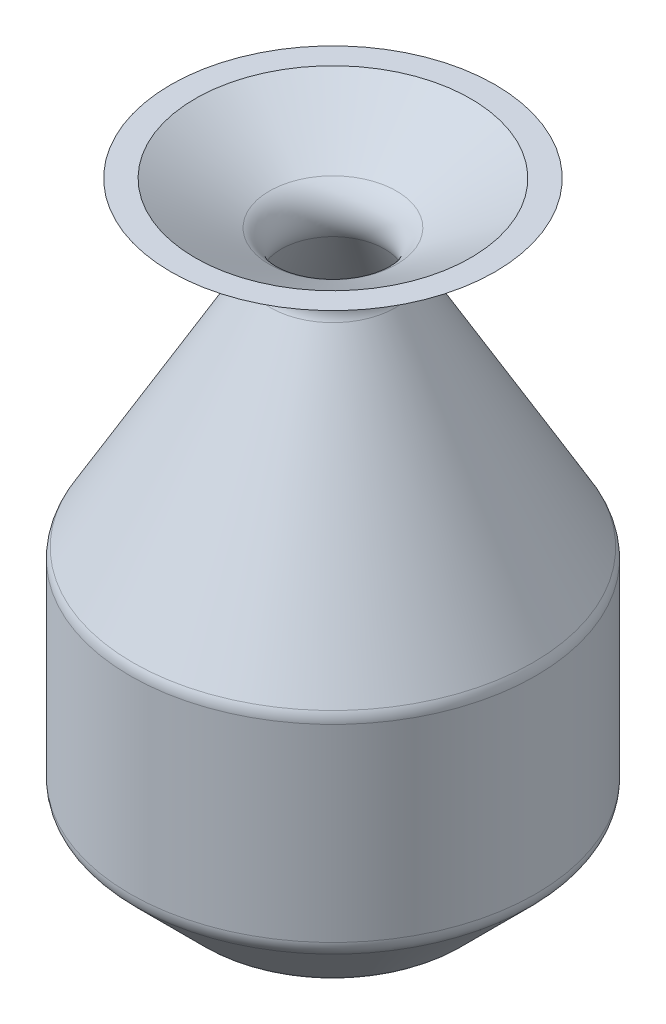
from build123d import *

# Parameters (mm, degrees)
SVUOTA1_T = -3


with BuildPart() as part:
    # Schizzo1 → Rivoluzione1 (revolve)
    with BuildSketch(Plane.XY, mode=Mode.PRIVATE) as rivoluzione1_sk:
        with BuildLine():
            Line((0, 0), (-27.928932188, 0))
            ThreePointArc((-27.928932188, 0), (-29.84234935, 0.380602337), (-31.464466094, 1.464466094))
            Line((-31.464466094, 1.464466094), (-48.535533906, 18.535533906))
            ThreePointArc((-48.535533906, 18.535533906), (-49.619397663, 20.15765065), (-50, 22.071067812))
            Line((-50, 22.071067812), (-50, 68.660254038))
            ThreePointArc((-50, 68.660254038), (-49.829629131, 69.954349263), (-49.330127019, 71.160254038))
            Line((-49.330127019, 71.160254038), (-15.358983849, 130))
            ThreePointArc((-15.358983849, 130), (-14.859481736, 133.794095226), (-17.189110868, 136.830127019))
            Line((-17.189110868, 136.830127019), (-40, 150))
            Line((-40, 150), (0, 150))
            Line((0, 150), (0, 0))
        make_face()
    revolve(rivoluzione1_sk.sketch.rotate(Axis((0, 198.025252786, 0), (0, -1, 0)), 270), axis=Axis((0, 198.025252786, 0), (0, -1, 0)))

    # Svuota1
    svuota1_openings = [part.faces().sort_by_distance(p)[0] for p in [
        (0, 150, 0),
    ]]
    offset(amount=SVUOTA1_T, openings=svuota1_openings, kind=Kind.INTERSECTION)


solid = part.part
